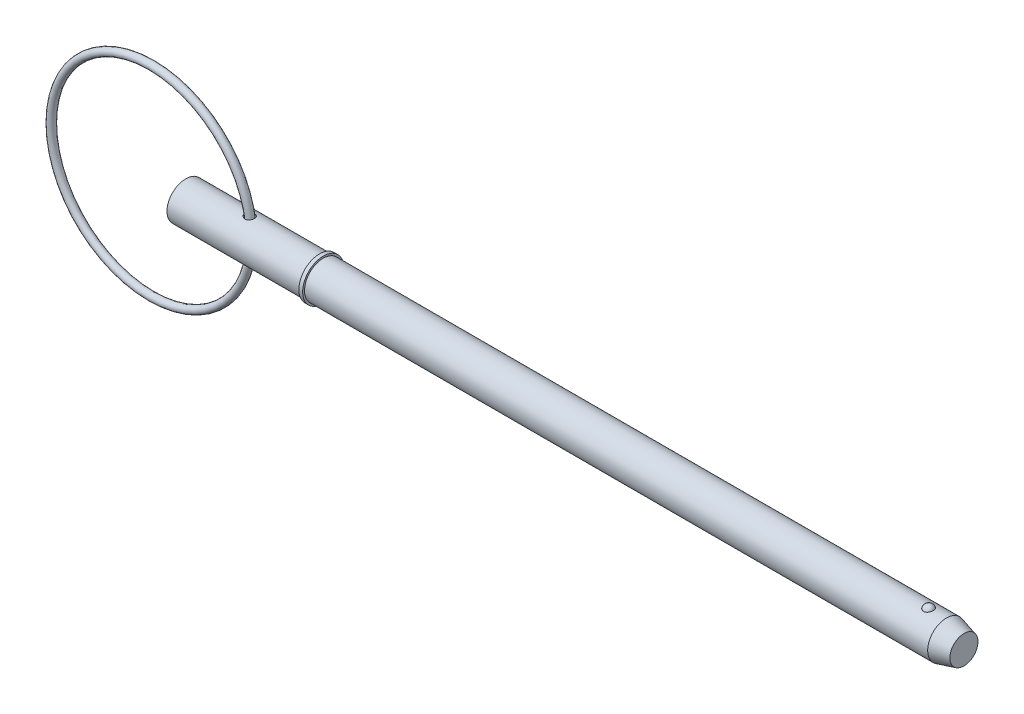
ISO-10303-21;
HEADER;
FILE_DESCRIPTION(('STEP AP214'),'2;1');
FILE_NAME('part.step','',(''),(''),'','','');
FILE_SCHEMA(('AUTOMOTIVE_DESIGN { 1 0 10303 214 1 1 1 1 }'));
ENDSEC;
DATA;
#1=APPLICATION_CONTEXT('core data for automotive mechanical design processes');
#2=APPLICATION_PROTOCOL_DEFINITION('international standard','automotive_design',2000,#1);
#3=PRODUCT_CONTEXT('',#1,'mechanical');
#4=PRODUCT('Part','Part','',(#3));
#5=PRODUCT_RELATED_PRODUCT_CATEGORY('part','',(#4));
#6=PRODUCT_DEFINITION_FORMATION('','',#4);
#7=PRODUCT_DEFINITION_CONTEXT('part definition',#1,'design');
#8=PRODUCT_DEFINITION('design','',#6,#7);
#9=PRODUCT_DEFINITION_SHAPE('','',#8);
#10=(LENGTH_UNIT() NAMED_UNIT(*) SI_UNIT(.MILLI.,.METRE.));
#11=(NAMED_UNIT(*) PLANE_ANGLE_UNIT() SI_UNIT($,.RADIAN.));
#12=(NAMED_UNIT(*) SI_UNIT($,.STERADIAN.) SOLID_ANGLE_UNIT());
#13=UNCERTAINTY_MEASURE_WITH_UNIT(LENGTH_MEASURE(1.E-05),#10,'distance_accuracy_value','');
#14=(GEOMETRIC_REPRESENTATION_CONTEXT(3) GLOBAL_UNCERTAINTY_ASSIGNED_CONTEXT((#13)) GLOBAL_UNIT_ASSIGNED_CONTEXT((#10,
#11,#12)) REPRESENTATION_CONTEXT('',''));
#15=CARTESIAN_POINT('',(0.,0.,0.));
#16=DIRECTION('',(0.,0.,1.));
#17=DIRECTION('',(1.,0.,0.));
#18=AXIS2_PLACEMENT_3D('',#15,#16,#17);
#19=CARTESIAN_POINT('',(-4.3552379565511,0.,0.));
#20=DIRECTION('',(0.,0.,1.));
#21=DIRECTION('',(1.,0.,0.));
#22=AXIS2_PLACEMENT_3D('',#19,#20,#21);
#23=TOROIDAL_SURFACE('',#22,12.7,0.476000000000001);
#24=CARTESIAN_POINT('',(8.8207620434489,0.,0.));
#25=VERTEX_POINT('',#24);
#26=VERTEX_LOOP('',#25);
#27=FACE_BOUND('',#26,.T.);
#28=ADVANCED_FACE('P0_F12',(#27),#23,.T.);
#29=CLOSED_SHELL('',(#28));
#30=MANIFOLD_SOLID_BREP('P0_B1',#29);
#31=CARTESIAN_POINT('',(0.,0.,0.));
#32=DIRECTION('',(1.,0.,0.));
#33=DIRECTION('',(0.,0.,-1.));
#34=AXIS2_PLACEMENT_3D('',#31,#32,#33);
#35=CYLINDRICAL_SURFACE('',#34,2.38);
#36=CARTESIAN_POINT('',(7.65248265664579,2.35074198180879,-0.372037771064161));
#37=CARTESIAN_POINT('',(7.67546616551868,2.34644965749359,-0.399158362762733));
#38=CARTESIAN_POINT('',(7.70081651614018,2.34199234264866,-0.424274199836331));
#39=CARTESIAN_POINT('',(7.75542747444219,2.33326580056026,-0.46990771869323));
#40=CARTESIAN_POINT('',(7.78469342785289,2.32899684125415,-0.49041900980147));
#41=CARTESIAN_POINT('',(7.8462833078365,2.32114904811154,-0.526312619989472));
#42=CARTESIAN_POINT('',(7.87860537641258,2.31756979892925,-0.541698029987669));
#43=CARTESIAN_POINT('',(7.9454452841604,2.31153734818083,-0.566889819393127));
#44=CARTESIAN_POINT('',(7.97996214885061,2.30908365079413,-0.576698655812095));
#45=CARTESIAN_POINT('',(8.05000735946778,2.30564492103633,-0.590297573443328));
#46=CARTESIAN_POINT('',(8.0855275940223,2.30465036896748,-0.594126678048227));
#47=CARTESIAN_POINT('',(8.15670718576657,2.30426876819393,-0.595606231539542));
#48=CARTESIAN_POINT('',(8.1923664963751,2.30488122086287,-0.593258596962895));
#49=CARTESIAN_POINT('',(8.26077822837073,2.30759475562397,-0.582609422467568));
#50=CARTESIAN_POINT('',(8.29358437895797,2.30961492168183,-0.574631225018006));
#51=CARTESIAN_POINT('',(8.35727060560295,2.31483318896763,-0.553233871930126));
#52=CARTESIAN_POINT('',(8.38815097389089,2.31803111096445,-0.53981554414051));
#53=CARTESIAN_POINT('',(8.44618254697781,2.3251225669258,-0.508384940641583));
#54=CARTESIAN_POINT('',(8.47341743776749,2.32899254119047,-0.490521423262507));
#55=CARTESIAN_POINT('',(8.5244826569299,2.33706025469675,-0.450515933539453));
#56=CARTESIAN_POINT('',(8.54831285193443,2.34125800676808,-0.428373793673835));
#57=CARTESIAN_POINT('',(8.5921621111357,2.34956202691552,-0.38020980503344));
#58=CARTESIAN_POINT('',(8.61214543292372,2.35366715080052,-0.354155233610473));
#59=CARTESIAN_POINT('',(8.64754725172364,2.36130301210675,-0.299034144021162));
#60=CARTESIAN_POINT('',(8.66296545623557,2.36483371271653,-0.269967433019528));
#61=CARTESIAN_POINT('',(8.68903776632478,2.37098548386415,-0.209215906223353));
#62=CARTESIAN_POINT('',(8.69962580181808,2.37359383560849,-0.177501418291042));
#63=CARTESIAN_POINT('',(8.71546966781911,2.37755210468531,-0.112692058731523));
#64=CARTESIAN_POINT('',(8.72072552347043,2.37890202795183,-0.0795971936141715));
#65=CARTESIAN_POINT('',(8.72577448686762,2.38019811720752,-0.0129544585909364));
#66=CARTESIAN_POINT('',(8.72556573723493,2.38014380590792,0.0205935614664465));
#67=CARTESIAN_POINT('',(8.71968604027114,2.37863606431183,0.0871753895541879));
#68=CARTESIAN_POINT('',(8.71401506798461,2.37718262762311,0.120209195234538));
#69=CARTESIAN_POINT('',(8.69736472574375,2.37303648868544,0.184779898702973));
#70=CARTESIAN_POINT('',(8.68639268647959,2.37034549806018,0.216318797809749));
#71=CARTESIAN_POINT('',(8.65941400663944,2.36401552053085,0.277063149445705));
#72=CARTESIAN_POINT('',(8.6434071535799,2.36037649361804,0.306268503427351));
#73=CARTESIAN_POINT('',(8.60670627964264,2.35253749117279,0.361595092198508));
#74=CARTESIAN_POINT('',(8.58600040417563,2.34833610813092,0.387708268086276));
#75=CARTESIAN_POINT('',(8.54044852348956,2.33984863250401,0.436017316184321));
#76=CARTESIAN_POINT('',(8.51560272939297,2.33556254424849,0.458213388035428));
#77=CARTESIAN_POINT('',(8.46260111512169,2.32742099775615,0.497916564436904));
#78=CARTESIAN_POINT('',(8.43446763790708,2.32356294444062,0.51545294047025));
#79=CARTESIAN_POINT('',(8.37555109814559,2.31668866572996,0.545520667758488));
#80=CARTESIAN_POINT('',(8.34476845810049,2.31367230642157,0.558052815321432));
#81=CARTESIAN_POINT('',(8.28194930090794,2.30886128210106,0.57763341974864));
#82=CARTESIAN_POINT('',(8.24993988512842,2.30704826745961,0.584764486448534));
#83=CARTESIAN_POINT('',(8.18514558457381,2.30475365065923,0.593744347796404));
#84=CARTESIAN_POINT('',(8.15236068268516,2.30427207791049,0.595593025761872));
#85=CARTESIAN_POINT('',(8.08670515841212,2.30466513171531,0.594069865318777));
#86=CARTESIAN_POINT('',(8.05383545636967,2.30554895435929,0.590662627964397));
#87=CARTESIAN_POINT('',(7.98908593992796,2.30856010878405,0.578780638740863));
#88=CARTESIAN_POINT('',(7.95720636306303,2.31068773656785,0.570304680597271));
#89=CARTESIAN_POINT('',(7.89377258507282,2.31605973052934,0.54809064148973));
#90=CARTESIAN_POINT('',(7.86230095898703,2.31935100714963,0.534128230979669));
#91=CARTESIAN_POINT('',(7.80205133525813,2.32664713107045,0.501391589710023));
#92=CARTESIAN_POINT('',(7.77327429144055,2.33065222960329,0.48261566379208));
#93=CARTESIAN_POINT('',(7.7179634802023,2.3391254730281,0.439760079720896));
#94=CARTESIAN_POINT('',(7.69158313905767,2.3436062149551,0.415484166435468));
#95=CARTESIAN_POINT('',(7.64339516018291,2.35235146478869,0.362706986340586));
#96=CARTESIAN_POINT('',(7.62158727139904,2.35661598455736,0.334205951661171));
#97=CARTESIAN_POINT('',(7.58382605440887,2.36432007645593,0.274368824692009));
#98=CARTESIAN_POINT('',(7.56774982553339,2.36777633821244,0.243112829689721));
#99=CARTESIAN_POINT('',(7.54152169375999,2.3735493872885,0.178112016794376));
#100=CARTESIAN_POINT('',(7.53136536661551,2.3758670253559,0.14436907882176));
#101=CARTESIAN_POINT('',(7.51809691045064,2.37891982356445,0.0783638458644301));
#102=CARTESIAN_POINT('',(7.5144720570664,2.37976992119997,0.0462095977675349));
#103=CARTESIAN_POINT('',(7.51285288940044,2.38014795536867,-0.0182487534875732));
#104=CARTESIAN_POINT('',(7.5148575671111,2.37967612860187,-0.0505528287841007));
#105=CARTESIAN_POINT('',(7.52413867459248,2.37752661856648,-0.112617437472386));
#106=CARTESIAN_POINT('',(7.53113538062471,2.37591295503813,-0.14242285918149));
#107=CARTESIAN_POINT('',(7.5497775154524,2.37172196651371,-0.200451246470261));
#108=CARTESIAN_POINT('',(7.56142049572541,2.3691451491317,-0.228675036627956));
#109=CARTESIAN_POINT('',(7.58571901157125,2.36396321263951,-0.276620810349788));
#110=CARTESIAN_POINT('',(7.59751818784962,2.36150235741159,-0.296799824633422));
#111=CARTESIAN_POINT('',(7.62336661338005,2.35629864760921,-0.33561908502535));
#112=CARTESIAN_POINT('',(7.63741608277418,2.353555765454,-0.354259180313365));
#113=CARTESIAN_POINT('',(7.65248265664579,2.35074198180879,-0.372037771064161));
#114=B_SPLINE_CURVE_WITH_KNOTS('',3,(#36,#37,#38,#39,#40,#41,#42,#43,#44,#45,#46,#47,#48,#49,
#50,#51,#52,#53,#54,#55,#56,#57,#58,#59,#60,#61,#62,#63,#64,#65,#66,#67,#68,#69,#70,#71,#72,#73,
#74,#75,#76,#77,#78,#79,#80,#81,#82,#83,#84,#85,#86,#87,#88,#89,#90,#91,#92,#93,#94,#95,#96,#97,
#98,#99,#100,#101,#102,#103,#104,#105,#106,#107,#108,#109,#110,#111,#112,#113),.UNSPECIFIED.,
.T.,.F.,(4,2,2,2,2,2,2,2,2,2,2,2,2,2,2,2,2,2,2,2,2,2,2,2,2,2,2,2,2,2,2,2,2,2,2,2,2,2,4),(0.,
0.107335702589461,0.214819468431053,0.322238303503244,0.429609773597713,0.536277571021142,
0.642912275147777,0.743874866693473,0.844822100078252,0.942762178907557,1.04070609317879,
1.1395202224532,1.23834068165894,1.33847507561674,1.43860899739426,1.53877695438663,
1.63894536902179,1.73897565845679,1.83901017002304,1.93929990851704,2.03958453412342,
2.13922343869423,2.23884648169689,2.33691317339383,2.4349820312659,2.53371427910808,
2.63247003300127,2.73577311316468,2.83911262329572,2.94697761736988,3.05483668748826,
3.16021984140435,3.26552413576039,3.36212700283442,3.45871257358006,3.55027266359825,
3.64178456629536,3.71214035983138,3.78250304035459),.UNSPECIFIED.);
#115=CARTESIAN_POINT('',(7.65248265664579,2.35074198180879,-0.372037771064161));
#116=VERTEX_POINT('',#115);
#117=EDGE_CURVE('P1_E42',#116,#116,#114,.T.);
#118=ORIENTED_EDGE('',*,*,#117,.T.);
#119=EDGE_LOOP('',(#118));
#120=FACE_BOUND('',#119,.T.);
#121=CARTESIAN_POINT('',(0.,0.,0.));
#122=DIRECTION('',(1.,0.,0.));
#123=DIRECTION('',(0.,0.,-1.));
#124=AXIS2_PLACEMENT_3D('',#121,#122,#123);
#125=CIRCLE('',#124,2.38);
#126=CARTESIAN_POINT('',(0.,0.,-2.38));
#127=VERTEX_POINT('',#126);
#128=EDGE_CURVE('P1_E9',#127,#127,#125,.T.);
#129=ORIENTED_EDGE('',*,*,#128,.T.);
#130=EDGE_LOOP('',(#129));
#131=FACE_BOUND('',#130,.T.);
#132=CARTESIAN_POINT('',(16.974,0.,0.));
#133=DIRECTION('',(1.,0.,0.));
#134=DIRECTION('',(0.,0.,-1.));
#135=AXIS2_PLACEMENT_3D('',#132,#133,#134);
#136=CIRCLE('',#135,2.38);
#137=CARTESIAN_POINT('',(16.974,0.,-2.38));
#138=VERTEX_POINT('',#137);
#139=EDGE_CURVE('P1_E25',#138,#138,#136,.T.);
#140=ORIENTED_EDGE('',*,*,#139,.F.);
#141=EDGE_LOOP('',(#140));
#142=FACE_BOUND('',#141,.T.);
#143=CARTESIAN_POINT('',(7.65248265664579,-2.35074198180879,-0.372037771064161));
#144=CARTESIAN_POINT('',(7.63152023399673,-2.35465684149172,-0.347300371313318));
#145=CARTESIAN_POINT('',(7.61251328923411,-2.35843676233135,-0.320880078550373));
#146=CARTESIAN_POINT('',(7.57904107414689,-2.36534227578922,-0.265218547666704));
#147=CARTESIAN_POINT('',(7.56457485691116,-2.36846800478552,-0.235977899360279));
#148=CARTESIAN_POINT('',(7.54072865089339,-2.37373250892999,-0.175281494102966));
#149=CARTESIAN_POINT('',(7.53136565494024,-2.37586798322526,-0.143818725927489));
#150=CARTESIAN_POINT('',(7.51825775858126,-2.37888184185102,-0.0796854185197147));
#151=CARTESIAN_POINT('',(7.51451093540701,-2.37976065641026,-0.0470152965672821));
#152=CARTESIAN_POINT('',(7.51287230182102,-2.38014359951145,0.0167788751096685));
#153=CARTESIAN_POINT('',(7.51468714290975,-2.37971660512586,0.0478953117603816));
#154=CARTESIAN_POINT('',(7.52344977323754,-2.37768530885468,0.109352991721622));
#155=CARTESIAN_POINT('',(7.53039746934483,-2.37608102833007,0.139694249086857));
#156=CARTESIAN_POINT('',(7.54900783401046,-2.37189301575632,0.198451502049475));
#157=CARTESIAN_POINT('',(7.56061918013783,-2.36931996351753,0.226884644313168));
#158=CARTESIAN_POINT('',(7.58810377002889,-2.36345094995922,0.281524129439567));
#159=CARTESIAN_POINT('',(7.60397804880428,-2.36015481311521,0.307729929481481));
#160=CARTESIAN_POINT('',(7.64062367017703,-2.35291979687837,0.359001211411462));
#161=CARTESIAN_POINT('',(7.66164499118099,-2.34895316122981,0.383883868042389));
#162=CARTESIAN_POINT('',(7.70730875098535,-2.34094029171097,0.430056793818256));
#163=CARTESIAN_POINT('',(7.73195270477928,-2.33689402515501,0.451345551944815));
#164=CARTESIAN_POINT('',(7.78628123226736,-2.32880869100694,0.491427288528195));
#165=CARTESIAN_POINT('',(7.81620889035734,-2.32479472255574,0.509896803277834));
#166=CARTESIAN_POINT('',(7.87876464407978,-2.31758417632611,0.541729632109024));
#167=CARTESIAN_POINT('',(7.91139323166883,-2.31438774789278,0.55509201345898));
#168=CARTESIAN_POINT('',(7.97916670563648,-2.30915137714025,0.576493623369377));
#169=CARTESIAN_POINT('',(8.0143485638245,-2.30713552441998,0.584422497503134));
#170=CARTESIAN_POINT('',(8.08560438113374,-2.30465258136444,0.594140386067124));
#171=CARTESIAN_POINT('',(8.12167802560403,-2.30418495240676,0.595931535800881));
#172=CARTESIAN_POINT('',(8.19193481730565,-2.30488473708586,0.59321801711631));
#173=CARTESIAN_POINT('',(8.2261295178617,-2.30597897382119,0.588995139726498));
#174=CARTESIAN_POINT('',(8.29321509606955,-2.30956729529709,0.574762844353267));
#175=CARTESIAN_POINT('',(8.32610629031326,-2.31206103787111,0.564754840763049));
#176=CARTESIAN_POINT('',(8.38816900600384,-2.31802118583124,0.539753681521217));
#177=CARTESIAN_POINT('',(8.41743993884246,-2.32144077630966,0.52499526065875));
#178=CARTESIAN_POINT('',(8.47302365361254,-2.32890801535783,0.490807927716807));
#179=CARTESIAN_POINT('',(8.49933643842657,-2.33295566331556,0.471379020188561));
#180=CARTESIAN_POINT('',(8.54827790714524,-2.3412242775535,0.428422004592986));
#181=CARTESIAN_POINT('',(8.57091094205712,-2.34544503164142,0.40489880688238));
#182=CARTESIAN_POINT('',(8.61197038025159,-2.35360640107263,0.354387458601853));
#183=CARTESIAN_POINT('',(8.63039647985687,-2.35754699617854,0.32739905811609));
#184=CARTESIAN_POINT('',(8.66284943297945,-2.36478461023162,0.270249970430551));
#185=CARTESIAN_POINT('',(8.67680333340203,-2.36807065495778,0.240046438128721));
#186=CARTESIAN_POINT('',(8.69957181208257,-2.37356560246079,0.177668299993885));
#187=CARTESIAN_POINT('',(8.70838630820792,-2.37577448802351,0.14549366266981));
#188=CARTESIAN_POINT('',(8.72068442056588,-2.37888446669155,0.0799353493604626));
#189=CARTESIAN_POINT('',(8.72414498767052,-2.37977990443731,0.046547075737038));
#190=CARTESIAN_POINT('',(8.72557509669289,-2.38014803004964,-0.0203543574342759));
#191=CARTESIAN_POINT('',(8.72354468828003,-2.37962073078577,-0.0538675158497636));
#192=CARTESIAN_POINT('',(8.71405606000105,-2.37720346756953,-0.119981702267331));
#193=CARTESIAN_POINT('',(8.70661109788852,-2.37531683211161,-0.152584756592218));
#194=CARTESIAN_POINT('',(8.68649336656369,-2.37038779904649,-0.216044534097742));
#195=CARTESIAN_POINT('',(8.67382040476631,-2.36734535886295,-0.24690119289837));
#196=CARTESIAN_POINT('',(8.64352750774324,-2.36042700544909,-0.306062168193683));
#197=CARTESIAN_POINT('',(8.62589743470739,-2.35654938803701,-0.334361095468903));
#198=CARTESIAN_POINT('',(8.58613860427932,-2.34839114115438,-0.387535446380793));
#199=CARTESIAN_POINT('',(8.5640098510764,-2.34411051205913,-0.412410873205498));
#200=CARTESIAN_POINT('',(8.51586484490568,-2.33563475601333,-0.457982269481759));
#201=CARTESIAN_POINT('',(8.48985596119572,-2.33143948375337,-0.478685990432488));
#202=CARTESIAN_POINT('',(8.43462330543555,-2.32360655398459,-0.515369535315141));
#203=CARTESIAN_POINT('',(8.40540000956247,-2.31996881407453,-0.531350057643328));
#204=CARTESIAN_POINT('',(8.34502624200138,-2.31371771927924,-0.557938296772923));
#205=CARTESIAN_POINT('',(8.31391082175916,-2.31108995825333,-0.568622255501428));
#206=CARTESIAN_POINT('',(8.25027207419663,-2.30707117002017,-0.584715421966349));
#207=CARTESIAN_POINT('',(8.21774884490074,-2.30568005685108,-0.590124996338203));
#208=CARTESIAN_POINT('',(8.15238918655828,-2.30427145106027,-0.595601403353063));
#209=CARTESIAN_POINT('',(8.11955499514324,-2.3042474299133,-0.595693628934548));
#210=CARTESIAN_POINT('',(8.05430726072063,-2.30552664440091,-0.590722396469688));
#211=CARTESIAN_POINT('',(8.02189380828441,-2.3068301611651,-0.585657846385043));
#212=CARTESIAN_POINT('',(7.95720150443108,-2.31066076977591,-0.570360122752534));
#213=CARTESIAN_POINT('',(7.92496602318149,-2.31322859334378,-0.55995436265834));
#214=CARTESIAN_POINT('',(7.86260707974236,-2.31930140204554,-0.534242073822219));
#215=CARTESIAN_POINT('',(7.83248403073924,-2.32280656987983,-0.518934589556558));
#216=CARTESIAN_POINT('',(7.77533132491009,-2.33034138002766,-0.483968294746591));
#217=CARTESIAN_POINT('',(7.74827623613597,-2.33436601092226,-0.464349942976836));
#218=CARTESIAN_POINT('',(7.69762060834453,-2.34255524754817,-0.4210920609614));
#219=CARTESIAN_POINT('',(7.67401956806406,-2.34671983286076,-0.397453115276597));
#220=CARTESIAN_POINT('',(7.65248265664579,-2.35074198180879,-0.372037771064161));
#221=B_SPLINE_CURVE_WITH_KNOTS('',3,(#143,#144,#145,#146,#147,#148,#149,#150,#151,#152,#153,
#154,#155,#156,#157,#158,#159,#160,#161,#162,#163,#164,#165,#166,#167,#168,#169,#170,#171,#172,
#173,#174,#175,#176,#177,#178,#179,#180,#181,#182,#183,#184,#185,#186,#187,#188,#189,#190,#191,
#192,#193,#194,#195,#196,#197,#198,#199,#200,#201,#202,#203,#204,#205,#206,#207,#208,#209,#210,
#211,#212,#213,#214,#215,#216,#217,#218,#219,#220),.UNSPECIFIED.,.T.,.F.,(4,2,2,2,2,2,2,2,2,2,2,
2,2,2,2,2,2,2,2,2,2,2,2,2,2,2,2,2,2,2,2,2,2,2,2,2,2,2,4),(0.,0.0978755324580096,
0.19573064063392,0.293909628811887,0.39205499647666,0.48511441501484,0.578172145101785,
0.670232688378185,0.762315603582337,0.860342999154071,0.958411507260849,1.06411708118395,
1.16984195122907,1.27765506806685,1.38543067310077,1.48831936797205,1.59118291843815,
1.68959047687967,1.78799793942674,1.88628818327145,1.98458551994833,2.08441314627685,
2.18424236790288,2.28450017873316,2.38475708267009,2.48476932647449,2.58478525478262,
2.68500723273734,2.78522911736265,2.88526302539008,2.98528213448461,3.08381637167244,
3.18234375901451,3.28040059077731,3.37847819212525,3.4799455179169,3.58143263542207,
3.68200512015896,3.78256299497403),.UNSPECIFIED.);
#222=CARTESIAN_POINT('',(7.65248265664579,-2.35074198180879,-0.372037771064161));
#223=VERTEX_POINT('',#222);
#224=EDGE_CURVE('P1_E17',#223,#223,#221,.T.);
#225=ORIENTED_EDGE('',*,*,#224,.T.);
#226=EDGE_LOOP('',(#225));
#227=FACE_BOUND('',#226,.T.);
#228=ADVANCED_FACE('P1_F13',(#120,#131,#142,#227),#35,.T.);
#229=CARTESIAN_POINT('',(0.,0.,0.));
#230=DIRECTION('',(1.,0.,0.));
#231=DIRECTION('',(0.,0.,-1.));
#232=AXIS2_PLACEMENT_3D('',#229,#230,#231);
#233=CYLINDRICAL_SURFACE('',#232,2.38);
#234=CARTESIAN_POINT('',(96.5094297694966,0.,0.));
#235=DIRECTION('',(1.,0.,0.));
#236=DIRECTION('',(0.,0.,-1.));
#237=AXIS2_PLACEMENT_3D('',#234,#235,#236);
#238=CIRCLE('',#237,2.38);
#239=CARTESIAN_POINT('',(96.5094297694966,0.,-2.38));
#240=VERTEX_POINT('',#239);
#241=EDGE_CURVE('P1_E99',#240,#240,#238,.T.);
#242=ORIENTED_EDGE('',*,*,#241,.F.);
#243=EDGE_LOOP('',(#242));
#244=FACE_BOUND('',#243,.T.);
#245=CARTESIAN_POINT('',(17.45,0.,0.));
#246=DIRECTION('',(1.,0.,0.));
#247=DIRECTION('',(0.,0.,-1.));
#248=AXIS2_PLACEMENT_3D('',#245,#246,#247);
#249=CIRCLE('',#248,2.38);
#250=CARTESIAN_POINT('',(17.45,0.,-2.38));
#251=VERTEX_POINT('',#250);
#252=EDGE_CURVE('P1_E96',#251,#251,#249,.T.);
#253=ORIENTED_EDGE('',*,*,#252,.T.);
#254=EDGE_LOOP('',(#253));
#255=FACE_BOUND('',#254,.T.);
#256=CARTESIAN_POINT('',(94.2634492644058,2.29215686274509,0.640637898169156));
#257=CARTESIAN_POINT('',(94.2303559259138,2.29215737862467,0.640637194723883));
#258=CARTESIAN_POINT('',(94.1972546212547,2.29293179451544,0.637884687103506));
#259=CARTESIAN_POINT('',(94.1320176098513,2.29594030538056,0.626968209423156));
#260=CARTESIAN_POINT('',(94.0998823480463,2.29817506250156,0.618801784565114));
#261=CARTESIAN_POINT('',(94.0375402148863,2.30384308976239,0.597351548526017));
#262=CARTESIAN_POINT('',(94.0073305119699,2.30727454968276,0.584075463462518));
#263=CARTESIAN_POINT('',(93.9495674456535,2.31495941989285,0.552829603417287));
#264=CARTESIAN_POINT('',(93.9220141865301,2.31921286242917,0.534859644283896));
#265=CARTESIAN_POINT('',(93.8695938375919,2.32820213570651,0.494282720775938));
#266=CARTESIAN_POINT('',(93.8448050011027,2.33294694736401,0.471576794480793));
#267=CARTESIAN_POINT('',(93.7992169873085,2.34234144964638,0.422446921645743));
#268=CARTESIAN_POINT('',(93.7784185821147,2.34699112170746,0.396022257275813));
#269=CARTESIAN_POINT('',(93.7403580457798,2.35593942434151,0.33885587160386));
#270=CARTESIAN_POINT('',(93.7233051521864,2.36021170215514,0.307970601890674));
#271=CARTESIAN_POINT('',(93.6943607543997,2.3677057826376,0.24375057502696));
#272=CARTESIAN_POINT('',(93.6824701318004,2.37092740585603,0.210415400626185));
#273=CARTESIAN_POINT('',(93.6638076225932,2.37606901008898,0.141189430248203));
#274=CARTESIAN_POINT('',(93.6571956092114,2.37794816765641,0.105252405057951));
#275=CARTESIAN_POINT('',(93.6498095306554,2.38005135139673,0.0327351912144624));
#276=CARTESIAN_POINT('',(93.6490358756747,2.38027526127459,-0.00384504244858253));
#277=CARTESIAN_POINT('',(93.6533628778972,2.37903842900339,-0.076983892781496));
#278=CARTESIAN_POINT('',(93.6585202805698,2.37756141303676,-0.113538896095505));
#279=CARTESIAN_POINT('',(93.6747013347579,2.37305303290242,-0.185229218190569));
#280=CARTESIAN_POINT('',(93.6857251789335,2.37002161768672,-0.220364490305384));
#281=CARTESIAN_POINT('',(93.7133977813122,2.36273722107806,-0.288156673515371));
#282=CARTESIAN_POINT('',(93.7300389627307,2.35848588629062,-0.320816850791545));
#283=CARTESIAN_POINT('',(93.7685984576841,2.34923130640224,-0.382744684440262));
#284=CARTESIAN_POINT('',(93.790516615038,2.34422808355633,-0.4120124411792));
#285=CARTESIAN_POINT('',(93.8387549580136,2.33412555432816,-0.465830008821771));
#286=CARTESIAN_POINT('',(93.865002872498,2.32902887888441,-0.490444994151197));
#287=CARTESIAN_POINT('',(93.9214769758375,2.31926941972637,-0.534700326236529));
#288=CARTESIAN_POINT('',(93.951702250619,2.31460653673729,-0.554341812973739));
#289=CARTESIAN_POINT('',(94.0140618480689,2.30645675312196,-0.587312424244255));
#290=CARTESIAN_POINT('',(94.0460780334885,2.3029315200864,-0.600855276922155));
#291=CARTESIAN_POINT('',(94.1120795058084,2.29725171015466,-0.622220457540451));
#292=CARTESIAN_POINT('',(94.1460641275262,2.29509667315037,-0.630044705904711));
#293=CARTESIAN_POINT('',(94.213299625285,2.29249264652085,-0.639452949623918));
#294=CARTESIAN_POINT('',(94.2465087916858,2.2919675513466,-0.641315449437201));
#295=CARTESIAN_POINT('',(94.312763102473,2.2924684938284,-0.639522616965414));
#296=CARTESIAN_POINT('',(94.3458082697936,2.29349430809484,-0.635868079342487));
#297=CARTESIAN_POINT('',(94.4101025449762,2.29694059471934,-0.623301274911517));
#298=CARTESIAN_POINT('',(94.4413744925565,2.29933234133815,-0.614497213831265));
#299=CARTESIAN_POINT('',(94.5019952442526,2.30522511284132,-0.592006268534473));
#300=CARTESIAN_POINT('',(94.5313438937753,2.30872622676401,-0.578318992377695));
#301=CARTESIAN_POINT('',(94.5880369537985,2.31655795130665,-0.546112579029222));
#302=CARTESIAN_POINT('',(94.6153201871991,2.32090569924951,-0.527490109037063));
#303=CARTESIAN_POINT('',(94.6664904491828,2.32992206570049,-0.486117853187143));
#304=CARTESIAN_POINT('',(94.6903767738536,2.33459075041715,-0.463367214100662));
#305=CARTESIAN_POINT('',(94.7352722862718,2.34399834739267,-0.413220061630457));
#306=CARTESIAN_POINT('',(94.7560972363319,2.34873051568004,-0.385657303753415));
#307=CARTESIAN_POINT('',(94.7930564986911,2.35754932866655,-0.327455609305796));
#308=CARTESIAN_POINT('',(94.8091898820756,2.36163584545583,-0.296816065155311));
#309=CARTESIAN_POINT('',(94.8369822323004,2.36889321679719,-0.232047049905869));
#310=CARTESIAN_POINT('',(94.8484450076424,2.37202275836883,-0.197828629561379));
#311=CARTESIAN_POINT('',(94.8657523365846,2.37681926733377,-0.127900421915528));
#312=CARTESIAN_POINT('',(94.8715962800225,2.37848607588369,-0.0921904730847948));
#313=CARTESIAN_POINT('',(94.8776051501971,2.38020024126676,-0.0196348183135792));
#314=CARTESIAN_POINT('',(94.8776704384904,2.38021918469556,0.0172198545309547));
#315=CARTESIAN_POINT('',(94.8718689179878,2.37856356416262,0.0904219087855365));
#316=CARTESIAN_POINT('',(94.8660018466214,2.37688892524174,0.126769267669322));
#317=CARTESIAN_POINT('',(94.8484256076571,2.37201688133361,0.198028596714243));
#318=CARTESIAN_POINT('',(94.836699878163,2.36881516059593,0.232936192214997));
#319=CARTESIAN_POINT('',(94.8076354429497,2.36123444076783,0.300196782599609));
#320=CARTESIAN_POINT('',(94.7902967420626,2.3568554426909,0.332549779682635));
#321=CARTESIAN_POINT('',(94.7505350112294,2.3474466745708,0.393495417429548));
#322=CARTESIAN_POINT('',(94.7281528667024,2.34242227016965,0.422115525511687));
#323=CARTESIAN_POINT('',(94.6787391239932,2.33227293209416,0.475004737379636));
#324=CARTESIAN_POINT('',(94.6517076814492,2.32714800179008,0.499273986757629));
#325=CARTESIAN_POINT('',(94.5944988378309,2.31755359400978,0.542046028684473));
#326=CARTESIAN_POINT('',(94.5644297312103,2.31306986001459,0.560690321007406));
#327=CARTESIAN_POINT('',(94.5013869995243,2.30514125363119,0.592447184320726));
#328=CARTESIAN_POINT('',(94.4684158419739,2.30169550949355,0.605564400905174));
#329=CARTESIAN_POINT('',(94.4068424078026,2.2967774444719,0.623927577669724));
#330=CARTESIAN_POINT('',(94.3785555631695,2.29505839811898,0.630178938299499));
#331=CARTESIAN_POINT('',(94.3213308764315,2.29274795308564,0.638534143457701));
#332=CARTESIAN_POINT('',(94.2923931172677,2.29215641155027,0.640638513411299));
#333=CARTESIAN_POINT('',(94.2634492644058,2.29215686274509,0.640637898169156));
#334=B_SPLINE_CURVE_WITH_KNOTS('',3,(#256,#257,#258,#259,#260,#261,#262,#263,#264,#265,#266,
#267,#268,#269,#270,#271,#272,#273,#274,#275,#276,#277,#278,#279,#280,#281,#282,#283,#284,#285,
#286,#287,#288,#289,#290,#291,#292,#293,#294,#295,#296,#297,#298,#299,#300,#301,#302,#303,#304,
#305,#306,#307,#308,#309,#310,#311,#312,#313,#314,#315,#316,#317,#318,#319,#320,#321,#322,#323,
#324,#325,#326,#327,#328,#329,#330,#331,#332,#333),.UNSPECIFIED.,.T.,.F.,(4,2,2,2,2,2,2,2,2,2,2,
2,2,2,2,2,2,2,2,2,2,2,2,2,2,2,2,2,2,2,2,2,2,2,2,2,2,2,4),(0.,0.0991724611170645,
0.198389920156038,0.297457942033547,0.396529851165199,0.497927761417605,0.59934527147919,
0.705475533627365,0.811623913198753,0.920876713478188,1.03013718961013,1.14045177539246,
1.25076998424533,1.36093998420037,1.47110672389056,1.57959248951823,1.68805336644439,
1.79234266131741,1.89659691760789,1.99590391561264,2.09519661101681,2.19247425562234,
2.28975970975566,2.38926978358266,2.48880044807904,2.59293588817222,2.69709193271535,
2.80525821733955,2.91343624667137,3.0234791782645,3.13352698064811,3.24388765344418,
3.35424823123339,3.46374443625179,3.57323697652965,3.67968690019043,3.78604717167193,
3.87279565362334,3.95953314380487),.UNSPECIFIED.);
#335=CARTESIAN_POINT('',(94.2634492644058,2.29215686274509,0.640637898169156));
#336=VERTEX_POINT('',#335);
#337=EDGE_CURVE('P1_E34',#336,#336,#334,.T.);
#338=ORIENTED_EDGE('',*,*,#337,.T.);
#339=EDGE_LOOP('',(#338));
#340=FACE_BOUND('',#339,.T.);
#341=ADVANCED_FACE('P1_F46',(#244,#255,#340),#233,.T.);
#342=CARTESIAN_POINT('',(0.,0.,0.));
#343=DIRECTION('',(-1.,0.,0.));
#344=DIRECTION('',(0.,0.,1.));
#345=AXIS2_PLACEMENT_3D('',#342,#343,#344);
#346=PLANE('',#345);
#347=ORIENTED_EDGE('',*,*,#128,.F.);
#348=EDGE_LOOP('',(#347));
#349=FACE_BOUND('',#348,.T.);
#350=ADVANCED_FACE('P1_F15',(#349),#346,.T.);
#351=CARTESIAN_POINT('',(16.974,2.38,0.));
#352=DIRECTION('',(-1.,0.,0.));
#353=DIRECTION('',(0.,0.,1.));
#354=AXIS2_PLACEMENT_3D('',#351,#352,#353);
#355=PLANE('',#354);
#356=ORIENTED_EDGE('',*,*,#139,.T.);
#357=EDGE_LOOP('',(#356));
#358=FACE_BOUND('',#357,.T.);
#359=CARTESIAN_POINT('',(16.974,0.,0.));
#360=DIRECTION('',(1.,0.,0.));
#361=DIRECTION('',(0.,0.,-1.));
#362=AXIS2_PLACEMENT_3D('',#359,#360,#361);
#363=CIRCLE('',#362,2.618);
#364=CARTESIAN_POINT('',(16.974,0.,-2.618));
#365=VERTEX_POINT('',#364);
#366=EDGE_CURVE('P1_E30',#365,#365,#363,.T.);
#367=ORIENTED_EDGE('',*,*,#366,.F.);
#368=EDGE_LOOP('',(#367));
#369=FACE_BOUND('',#368,.T.);
#370=ADVANCED_FACE('P1_F81',(#358,#369),#355,.T.);
#371=CARTESIAN_POINT('',(0.,0.,0.));
#372=DIRECTION('',(1.,0.,0.));
#373=DIRECTION('',(0.,0.,-1.));
#374=AXIS2_PLACEMENT_3D('',#371,#372,#373);
#375=CYLINDRICAL_SURFACE('',#374,2.618);
#376=ORIENTED_EDGE('',*,*,#366,.T.);
#377=EDGE_LOOP('',(#376));
#378=FACE_BOUND('',#377,.T.);
#379=CARTESIAN_POINT('',(17.45,0.,0.));
#380=DIRECTION('',(1.,0.,0.));
#381=DIRECTION('',(0.,0.,-1.));
#382=AXIS2_PLACEMENT_3D('',#379,#380,#381);
#383=CIRCLE('',#382,2.618);
#384=CARTESIAN_POINT('',(17.45,0.,-2.618));
#385=VERTEX_POINT('',#384);
#386=EDGE_CURVE('P1_E95',#385,#385,#383,.T.);
#387=ORIENTED_EDGE('',*,*,#386,.F.);
#388=EDGE_LOOP('',(#387));
#389=FACE_BOUND('',#388,.T.);
#390=ADVANCED_FACE('P1_F68',(#378,#389),#375,.T.);
#391=CARTESIAN_POINT('',(17.45,2.618,0.));
#392=DIRECTION('',(1.,0.,0.));
#393=DIRECTION('',(0.,0.,-1.));
#394=AXIS2_PLACEMENT_3D('',#391,#392,#393);
#395=PLANE('',#394);
#396=ORIENTED_EDGE('',*,*,#386,.T.);
#397=EDGE_LOOP('',(#396));
#398=FACE_BOUND('',#397,.T.);
#399=ORIENTED_EDGE('',*,*,#252,.F.);
#400=EDGE_LOOP('',(#399));
#401=FACE_BOUND('',#400,.T.);
#402=ADVANCED_FACE('P1_F62',(#398,#401),#395,.T.);
#403=CARTESIAN_POINT('',(98.73,0.,0.));
#404=DIRECTION('',(-1.,0.,0.));
#405=DIRECTION('',(0.,0.,1.));
#406=AXIS2_PLACEMENT_3D('',#403,#404,#405);
#407=CONICAL_SURFACE('',#406,1.78500000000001,0.261799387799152);
#408=ORIENTED_EDGE('',*,*,#241,.T.);
#409=EDGE_LOOP('',(#408));
#410=FACE_BOUND('',#409,.T.);
#411=CARTESIAN_POINT('',(98.73,0.,0.));
#412=DIRECTION('',(1.,0.,0.));
#413=DIRECTION('',(0.,0.,-1.));
#414=AXIS2_PLACEMENT_3D('',#411,#412,#413);
#415=CIRCLE('',#414,1.78500000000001);
#416=CARTESIAN_POINT('',(98.73,0.,-1.78500000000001));
#417=VERTEX_POINT('',#416);
#418=EDGE_CURVE('P1_E41',#417,#417,#415,.T.);
#419=ORIENTED_EDGE('',*,*,#418,.F.);
#420=EDGE_LOOP('',(#419));
#421=FACE_BOUND('',#420,.T.);
#422=ADVANCED_FACE('P1_F59',(#410,#421),#407,.T.);
#423=CARTESIAN_POINT('',(98.73,1.78500000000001,0.));
#424=DIRECTION('',(1.,0.,0.));
#425=DIRECTION('',(0.,0.,-1.));
#426=AXIS2_PLACEMENT_3D('',#423,#424,#425);
#427=PLANE('',#426);
#428=ORIENTED_EDGE('',*,*,#418,.T.);
#429=EDGE_LOOP('',(#428));
#430=FACE_BOUND('',#429,.T.);
#431=ADVANCED_FACE('P1_F55',(#430),#427,.T.);
#432=CARTESIAN_POINT('',(94.2634492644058,2.14199999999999,0.));
#433=DIRECTION('',(-1.,0.,0.));
#434=DIRECTION('',(0.,-1.,0.));
#435=AXIS2_PLACEMENT_3D('',#432,#433,#434);
#436=SPHERICAL_SURFACE('',#435,0.658000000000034);
#437=ORIENTED_EDGE('',*,*,#337,.F.);
#438=EDGE_LOOP('',(#437));
#439=FACE_BOUND('',#438,.T.);
#440=ADVANCED_FACE('P1_F50',(#439),#436,.T.);
#441=CARTESIAN_POINT('',(-4.3552379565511,0.,0.));
#442=DIRECTION('',(0.,0.,1.));
#443=DIRECTION('',(1.,0.,0.));
#444=AXIS2_PLACEMENT_3D('',#441,#442,#443);
#445=TOROIDAL_SURFACE('',#444,12.7,0.594999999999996);
#446=ORIENTED_EDGE('',*,*,#224,.F.);
#447=EDGE_LOOP('',(#446));
#448=FACE_BOUND('',#447,.T.);
#449=ORIENTED_EDGE('',*,*,#117,.F.);
#450=EDGE_LOOP('',(#449));
#451=FACE_BOUND('',#450,.T.);
#452=ADVANCED_FACE('P1_F54',(#448,#451),#445,.F.);
#453=CLOSED_SHELL('',(#228,#341,#350,#370,#390,#402,#422,#431,#440,#452));
#454=MANIFOLD_SOLID_BREP('P1_B1',#453);
#455=ADVANCED_BREP_SHAPE_REPRESENTATION('',(#18,#30,#454),#14);
#456=SHAPE_DEFINITION_REPRESENTATION(#9,#455);
ENDSEC;
END-ISO-10303-21;
